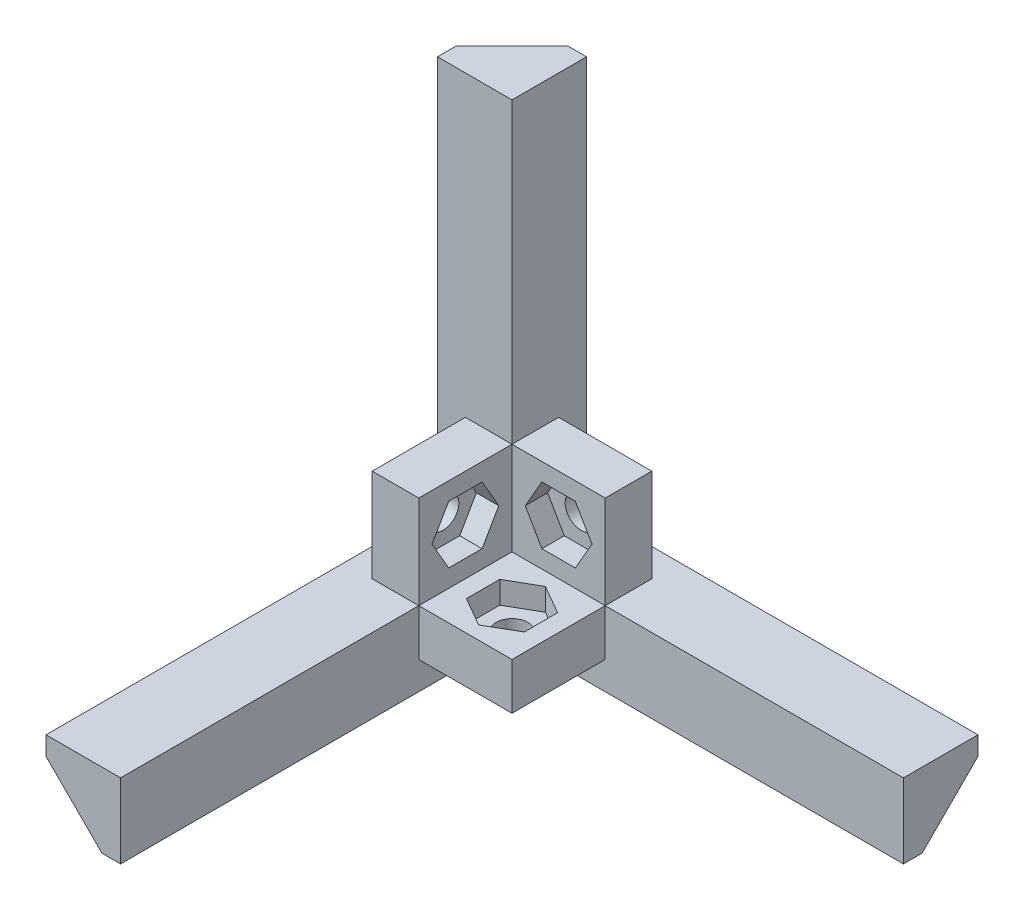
ISO-10303-21;
HEADER;
FILE_DESCRIPTION(('STEP AP214'),'2;1');
FILE_NAME('part.step','',(''),(''),'','','');
FILE_SCHEMA(('AUTOMOTIVE_DESIGN { 1 0 10303 214 1 1 1 1 }'));
ENDSEC;
DATA;
#1=APPLICATION_CONTEXT('core data for automotive mechanical design processes');
#2=APPLICATION_PROTOCOL_DEFINITION('international standard','automotive_design',2000,#1);
#3=PRODUCT_CONTEXT('',#1,'mechanical');
#4=PRODUCT('Part','Part','',(#3));
#5=PRODUCT_RELATED_PRODUCT_CATEGORY('part','',(#4));
#6=PRODUCT_DEFINITION_FORMATION('','',#4);
#7=PRODUCT_DEFINITION_CONTEXT('part definition',#1,'design');
#8=PRODUCT_DEFINITION('design','',#6,#7);
#9=PRODUCT_DEFINITION_SHAPE('','',#8);
#10=(LENGTH_UNIT() NAMED_UNIT(*) SI_UNIT(.MILLI.,.METRE.));
#11=(NAMED_UNIT(*) PLANE_ANGLE_UNIT() SI_UNIT($,.RADIAN.));
#12=(NAMED_UNIT(*) SI_UNIT($,.STERADIAN.) SOLID_ANGLE_UNIT());
#13=UNCERTAINTY_MEASURE_WITH_UNIT(LENGTH_MEASURE(1.E-05),#10,'distance_accuracy_value','');
#14=(GEOMETRIC_REPRESENTATION_CONTEXT(3) GLOBAL_UNCERTAINTY_ASSIGNED_CONTEXT((#13)) GLOBAL_UNIT_ASSIGNED_CONTEXT((#10,
#11,#12)) REPRESENTATION_CONTEXT('',''));
#15=CARTESIAN_POINT('',(0.,0.,0.));
#16=DIRECTION('',(0.,0.,1.));
#17=DIRECTION('',(1.,0.,0.));
#18=AXIS2_PLACEMENT_3D('',#15,#16,#17);
#19=CARTESIAN_POINT('',(42.,0.,8.));
#20=DIRECTION('',(0.,-1.,0.));
#21=DIRECTION('',(0.,0.,-1.));
#22=AXIS2_PLACEMENT_3D('',#19,#20,#21);
#23=PLANE('',#22);
#24=DIRECTION('',(0.,0.,-1.));
#25=VECTOR('',#24,1.);
#26=CARTESIAN_POINT('',(0.,0.,7.99999999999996));
#27=LINE('',#26,#25);
#28=CARTESIAN_POINT('',(0.,0.,18.));
#29=VERTEX_POINT('',#28);
#30=CARTESIAN_POINT('',(0.,0.,7.99999999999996));
#31=VERTEX_POINT('',#30);
#32=EDGE_CURVE('E390',#29,#31,#27,.T.);
#33=ORIENTED_EDGE('',*,*,#32,.F.);
#34=DIRECTION('',(-1.,0.,0.));
#35=VECTOR('',#34,1.);
#36=CARTESIAN_POINT('',(0.,0.,18.));
#37=LINE('',#36,#35);
#38=CARTESIAN_POINT('',(10.,0.,18.));
#39=VERTEX_POINT('',#38);
#40=EDGE_CURVE('E500',#39,#29,#37,.T.);
#41=ORIENTED_EDGE('',*,*,#40,.F.);
#42=DIRECTION('',(0.,0.,-1.));
#43=VECTOR('',#42,1.);
#44=CARTESIAN_POINT('',(10.,0.,18.));
#45=LINE('',#44,#43);
#46=CARTESIAN_POINT('',(10.,0.,8.));
#47=VERTEX_POINT('',#46);
#48=EDGE_CURVE('E503',#39,#47,#45,.T.);
#49=ORIENTED_EDGE('',*,*,#48,.T.);
#50=DIRECTION('',(-1.,0.,0.));
#51=VECTOR('',#50,1.);
#52=CARTESIAN_POINT('',(0.,0.,8.));
#53=LINE('',#52,#51);
#54=EDGE_CURVE('E519',#47,#31,#53,.T.);
#55=ORIENTED_EDGE('',*,*,#54,.T.);
#56=EDGE_LOOP('',(#33,#41,#49,#55));
#57=FACE_BOUND('',#56,.T.);
#58=DIRECTION('',(-0.866025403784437,0.,0.500000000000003));
#59=VECTOR('',#58,1.);
#60=CARTESIAN_POINT('',(8.10000000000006,0.,14.7897858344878));
#61=LINE('',#60,#59);
#62=CARTESIAN_POINT('',(8.10000000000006,0.,14.7897858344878));
#63=VERTEX_POINT('',#62);
#64=CARTESIAN_POINT('',(5.00000000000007,0.,16.5795716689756));
#65=VERTEX_POINT('',#64);
#66=EDGE_CURVE('E50',#63,#65,#61,.T.);
#67=ORIENTED_EDGE('',*,*,#66,.T.);
#68=DIRECTION('',(-0.86602540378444,0.,-0.499999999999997));
#69=VECTOR('',#68,1.);
#70=CARTESIAN_POINT('',(5.00000000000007,0.,16.5795716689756));
#71=LINE('',#70,#69);
#72=CARTESIAN_POINT('',(1.90000000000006,0.,14.7897858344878));
#73=VERTEX_POINT('',#72);
#74=EDGE_CURVE('E300',#65,#73,#71,.T.);
#75=ORIENTED_EDGE('',*,*,#74,.T.);
#76=DIRECTION('',(0.,0.,-1.));
#77=VECTOR('',#76,1.);
#78=CARTESIAN_POINT('',(1.90000000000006,0.,14.7897858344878));
#79=LINE('',#78,#77);
#80=CARTESIAN_POINT('',(1.90000000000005,0.,11.2102141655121));
#81=VERTEX_POINT('',#80);
#82=EDGE_CURVE('E303',#73,#81,#79,.T.);
#83=ORIENTED_EDGE('',*,*,#82,.T.);
#84=DIRECTION('',(0.866025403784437,0.,-0.500000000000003));
#85=VECTOR('',#84,1.);
#86=CARTESIAN_POINT('',(1.90000000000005,0.,11.2102141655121));
#87=LINE('',#86,#85);
#88=CARTESIAN_POINT('',(5.00000000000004,0.,9.42042833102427));
#89=VERTEX_POINT('',#88);
#90=EDGE_CURVE('E318',#81,#89,#87,.T.);
#91=ORIENTED_EDGE('',*,*,#90,.T.);
#92=DIRECTION('',(0.86602540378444,0.,0.499999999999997));
#93=VECTOR('',#92,1.);
#94=CARTESIAN_POINT('',(5.00000000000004,0.,9.42042833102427));
#95=LINE('',#94,#93);
#96=CARTESIAN_POINT('',(8.10000000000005,0.,11.2102141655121));
#97=VERTEX_POINT('',#96);
#98=EDGE_CURVE('E315',#89,#97,#95,.T.);
#99=ORIENTED_EDGE('',*,*,#98,.T.);
#100=DIRECTION('',(0.,0.,1.));
#101=VECTOR('',#100,1.);
#102=CARTESIAN_POINT('',(8.10000000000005,0.,11.2102141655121));
#103=LINE('',#102,#101);
#104=EDGE_CURVE('E313',#97,#63,#103,.T.);
#105=ORIENTED_EDGE('',*,*,#104,.T.);
#106=EDGE_LOOP('',(#67,#75,#83,#91,#99,#105));
#107=FACE_BOUND('',#106,.T.);
#108=ADVANCED_FACE('F33',(#57,#107),#23,.F.);
#109=CARTESIAN_POINT('',(5.00000000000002,42.0010000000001,13.));
#110=DIRECTION('',(0.,-1.,0.));
#111=DIRECTION('',(1.,0.,0.));
#112=AXIS2_PLACEMENT_3D('',#109,#110,#111);
#113=CYLINDRICAL_SURFACE('',#112,1.7);
#114=CARTESIAN_POINT('',(5.00000000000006,-5.,12.9999999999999));
#115=DIRECTION('',(0.,1.,0.));
#116=DIRECTION('',(0.,0.,1.));
#117=AXIS2_PLACEMENT_3D('',#114,#115,#116);
#118=CIRCLE('',#117,1.7);
#119=CARTESIAN_POINT('',(5.00000000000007,-5.,14.6999999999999));
#120=VERTEX_POINT('',#119);
#121=EDGE_CURVE('E332',#120,#120,#118,.T.);
#122=ORIENTED_EDGE('',*,*,#121,.F.);
#123=EDGE_LOOP('',(#122));
#124=FACE_BOUND('',#123,.T.);
#125=CARTESIAN_POINT('',(5.00000000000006,-2.4,12.9999999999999));
#126=DIRECTION('',(0.,1.,0.));
#127=DIRECTION('',(0.,0.,1.));
#128=AXIS2_PLACEMENT_3D('',#125,#126,#127);
#129=CIRCLE('',#128,1.7);
#130=CARTESIAN_POINT('',(5.00000000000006,-2.4,14.6999999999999));
#131=VERTEX_POINT('',#130);
#132=EDGE_CURVE('E37',#131,#131,#129,.T.);
#133=ORIENTED_EDGE('',*,*,#132,.T.);
#134=EDGE_LOOP('',(#133));
#135=FACE_BOUND('',#134,.T.);
#136=ADVANCED_FACE('F608',(#124,#135),#113,.F.);
#137=CARTESIAN_POINT('',(42.0010000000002,5.00000000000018,12.9999999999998));
#138=DIRECTION('',(-1.,0.,0.));
#139=DIRECTION('',(0.,-1.,0.));
#140=AXIS2_PLACEMENT_3D('',#137,#138,#139);
#141=CYLINDRICAL_SURFACE('',#140,1.7);
#142=CARTESIAN_POINT('',(-4.99999999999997,4.99999999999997,13.));
#143=DIRECTION('',(-1.,0.,0.));
#144=DIRECTION('',(0.,0.,1.));
#145=AXIS2_PLACEMENT_3D('',#142,#143,#144);
#146=CIRCLE('',#145,1.7);
#147=CARTESIAN_POINT('',(-4.99999999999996,4.99999999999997,14.7));
#148=VERTEX_POINT('',#147);
#149=EDGE_CURVE('E382',#148,#148,#146,.T.);
#150=ORIENTED_EDGE('',*,*,#149,.T.);
#151=EDGE_LOOP('',(#150));
#152=FACE_BOUND('',#151,.T.);
#153=CARTESIAN_POINT('',(-2.39999999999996,4.99999999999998,13.));
#154=DIRECTION('',(1.,0.,0.));
#155=DIRECTION('',(0.,1.,0.));
#156=AXIS2_PLACEMENT_3D('',#153,#154,#155);
#157=CIRCLE('',#156,1.7);
#158=CARTESIAN_POINT('',(-2.39999999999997,6.69999999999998,13.));
#159=VERTEX_POINT('',#158);
#160=EDGE_CURVE('E372',#159,#159,#157,.F.);
#161=ORIENTED_EDGE('',*,*,#160,.F.);
#162=EDGE_LOOP('',(#161));
#163=FACE_BOUND('',#162,.T.);
#164=ADVANCED_FACE('F605',(#152,#163),#141,.F.);
#165=CARTESIAN_POINT('',(0.,0.,8.));
#166=DIRECTION('',(0.,0.,-1.));
#167=DIRECTION('',(-1.,0.,0.));
#168=AXIS2_PLACEMENT_3D('',#165,#166,#167);
#169=PLANE('',#168);
#170=DIRECTION('',(0.,-1.,0.));
#171=VECTOR('',#170,1.);
#172=CARTESIAN_POINT('',(-5.00000000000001,9.99999999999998,7.99999999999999));
#173=LINE('',#172,#171);
#174=CARTESIAN_POINT('',(-5.00000000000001,9.99999999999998,8.));
#175=VERTEX_POINT('',#174);
#176=CARTESIAN_POINT('',(-4.99999999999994,0.,8.));
#177=VERTEX_POINT('',#176);
#178=EDGE_CURVE('E413',#175,#177,#173,.T.);
#179=ORIENTED_EDGE('',*,*,#178,.F.);
#180=DIRECTION('',(-1.,0.,0.));
#181=VECTOR('',#180,1.);
#182=CARTESIAN_POINT('',(-5.00000000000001,9.99999999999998,7.99999999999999));
#183=LINE('',#182,#181);
#184=CARTESIAN_POINT('',(0.,10.,7.99999999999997));
#185=VERTEX_POINT('',#184);
#186=EDGE_CURVE('E386',#185,#175,#183,.T.);
#187=ORIENTED_EDGE('',*,*,#186,.F.);
#188=DIRECTION('',(0.,1.,0.));
#189=VECTOR('',#188,1.);
#190=CARTESIAN_POINT('',(0.,0.,8.));
#191=LINE('',#190,#189);
#192=CARTESIAN_POINT('',(0.,42.,8.));
#193=VERTEX_POINT('',#192);
#194=EDGE_CURVE('E543',#185,#193,#191,.T.);
#195=ORIENTED_EDGE('',*,*,#194,.T.);
#196=DIRECTION('',(-1.,0.,0.));
#197=VECTOR('',#196,1.);
#198=CARTESIAN_POINT('',(0.,42.,8.));
#199=LINE('',#198,#197);
#200=CARTESIAN_POINT('',(-8.,42.,8.));
#201=VERTEX_POINT('',#200);
#202=EDGE_CURVE('E546',#193,#201,#199,.T.);
#203=ORIENTED_EDGE('',*,*,#202,.T.);
#204=DIRECTION('',(0.,-1.,0.));
#205=VECTOR('',#204,1.);
#206=CARTESIAN_POINT('',(-8.,42.,8.));
#207=LINE('',#206,#205);
#208=CARTESIAN_POINT('',(-8.,0.,8.));
#209=VERTEX_POINT('',#208);
#210=EDGE_CURVE('E548',#201,#209,#207,.T.);
#211=ORIENTED_EDGE('',*,*,#210,.T.);
#212=EDGE_CURVE('E529',#177,#209,#53,.T.);
#213=ORIENTED_EDGE('',*,*,#212,.F.);
#214=EDGE_LOOP('',(#179,#187,#195,#203,#211,#213));
#215=FACE_BOUND('',#214,.T.);
#216=ADVANCED_FACE('F607',(#215),#169,.F.);
#217=DIRECTION('',(0.5,-0.866025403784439,0.));
#218=VECTOR('',#217,1.);
#219=CARTESIAN_POINT('',(6.78978583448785,8.09999999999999,7.99999999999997));
#220=LINE('',#219,#218);
#221=CARTESIAN_POINT('',(6.78978583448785,8.09999999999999,8.));
#222=VERTEX_POINT('',#221);
#223=CARTESIAN_POINT('',(8.57957166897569,5.,7.99999999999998));
#224=VERTEX_POINT('',#223);
#225=EDGE_CURVE('E432',#222,#224,#220,.T.);
#226=ORIENTED_EDGE('',*,*,#225,.T.);
#227=DIRECTION('',(-0.5,-0.866025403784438,0.));
#228=VECTOR('',#227,1.);
#229=CARTESIAN_POINT('',(8.57957166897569,5.,7.99999999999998));
#230=LINE('',#229,#228);
#231=CARTESIAN_POINT('',(6.78978583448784,1.9,7.99999999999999));
#232=VERTEX_POINT('',#231);
#233=EDGE_CURVE('E421',#224,#232,#230,.T.);
#234=ORIENTED_EDGE('',*,*,#233,.T.);
#235=DIRECTION('',(-1.,0.,0.));
#236=VECTOR('',#235,1.);
#237=CARTESIAN_POINT('',(6.78978583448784,1.9,7.99999999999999));
#238=LINE('',#237,#236);
#239=CARTESIAN_POINT('',(3.21021416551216,1.9,7.99999999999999));
#240=VERTEX_POINT('',#239);
#241=EDGE_CURVE('E445',#232,#240,#238,.T.);
#242=ORIENTED_EDGE('',*,*,#241,.T.);
#243=DIRECTION('',(-0.5,0.866025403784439,0.));
#244=VECTOR('',#243,1.);
#245=CARTESIAN_POINT('',(3.21021416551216,1.9,7.99999999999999));
#246=LINE('',#245,#244);
#247=CARTESIAN_POINT('',(1.42042833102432,5.,7.99999999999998));
#248=VERTEX_POINT('',#247);
#249=EDGE_CURVE('E442',#240,#248,#246,.T.);
#250=ORIENTED_EDGE('',*,*,#249,.T.);
#251=DIRECTION('',(0.5,0.866025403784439,0.));
#252=VECTOR('',#251,1.);
#253=CARTESIAN_POINT('',(1.42042833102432,5.,7.99999999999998));
#254=LINE('',#253,#252);
#255=CARTESIAN_POINT('',(3.21021416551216,8.09999999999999,7.99999999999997));
#256=VERTEX_POINT('',#255);
#257=EDGE_CURVE('E439',#248,#256,#254,.T.);
#258=ORIENTED_EDGE('',*,*,#257,.T.);
#259=DIRECTION('',(1.,0.,0.));
#260=VECTOR('',#259,1.);
#261=CARTESIAN_POINT('',(3.21021416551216,8.09999999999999,7.99999999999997));
#262=LINE('',#261,#260);
#263=EDGE_CURVE('E435',#256,#222,#262,.T.);
#264=ORIENTED_EDGE('',*,*,#263,.T.);
#265=EDGE_LOOP('',(#226,#234,#242,#250,#258,#264));
#266=FACE_BOUND('',#265,.T.);
#267=DIRECTION('',(0.,-1.,0.));
#268=VECTOR('',#267,1.);
#269=CARTESIAN_POINT('',(0.,10.,7.99999999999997));
#270=LINE('',#269,#268);
#271=EDGE_CURVE('E397',#185,#31,#270,.T.);
#272=ORIENTED_EDGE('',*,*,#271,.T.);
#273=ORIENTED_EDGE('',*,*,#54,.F.);
#274=DIRECTION('',(0.,-1.,0.));
#275=VECTOR('',#274,1.);
#276=CARTESIAN_POINT('',(10.,10.,7.99999999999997));
#277=LINE('',#276,#275);
#278=CARTESIAN_POINT('',(10.,10.,7.99999999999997));
#279=VERTEX_POINT('',#278);
#280=EDGE_CURVE('E488',#279,#47,#277,.T.);
#281=ORIENTED_EDGE('',*,*,#280,.F.);
#282=DIRECTION('',(-1.,0.,0.));
#283=VECTOR('',#282,1.);
#284=CARTESIAN_POINT('',(0.,10.,7.99999999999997));
#285=LINE('',#284,#283);
#286=EDGE_CURVE('E470',#279,#185,#285,.T.);
#287=ORIENTED_EDGE('',*,*,#286,.T.);
#288=EDGE_LOOP('',(#272,#273,#281,#287));
#289=FACE_BOUND('',#288,.T.);
#290=ADVANCED_FACE('F615',(#266,#289),#169,.F.);
#291=DIRECTION('',(0.,0.,1.));
#292=VECTOR('',#291,1.);
#293=CARTESIAN_POINT('',(-4.99999999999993,0.,18.));
#294=LINE('',#293,#292);
#295=CARTESIAN_POINT('',(-4.99999999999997,0.,18.));
#296=VERTEX_POINT('',#295);
#297=EDGE_CURVE('E385',#177,#296,#294,.T.);
#298=ORIENTED_EDGE('',*,*,#297,.F.);
#299=ORIENTED_EDGE('',*,*,#212,.T.);
#300=DIRECTION('',(0.,0.,-1.));
#301=VECTOR('',#300,1.);
#302=CARTESIAN_POINT('',(-8.,0.,50.));
#303=LINE('',#302,#301);
#304=CARTESIAN_POINT('',(-8.,0.,50.));
#305=VERTEX_POINT('',#304);
#306=EDGE_CURVE('E533',#305,#209,#303,.T.);
#307=ORIENTED_EDGE('',*,*,#306,.F.);
#308=DIRECTION('',(-1.,0.,0.));
#309=VECTOR('',#308,1.);
#310=CARTESIAN_POINT('',(0.,0.,50.));
#311=LINE('',#310,#309);
#312=CARTESIAN_POINT('',(0.,0.,50.));
#313=VERTEX_POINT('',#312);
#314=EDGE_CURVE('E518',#313,#305,#311,.T.);
#315=ORIENTED_EDGE('',*,*,#314,.F.);
#316=DIRECTION('',(0.,0.,-1.));
#317=VECTOR('',#316,1.);
#318=CARTESIAN_POINT('',(0.,0.,50.));
#319=LINE('',#318,#317);
#320=EDGE_CURVE('E536',#313,#29,#319,.T.);
#321=ORIENTED_EDGE('',*,*,#320,.T.);
#322=DIRECTION('',(1.,0.,0.));
#323=VECTOR('',#322,1.);
#324=CARTESIAN_POINT('',(0.,0.,18.));
#325=LINE('',#324,#323);
#326=EDGE_CURVE('E400',#296,#29,#325,.T.);
#327=ORIENTED_EDGE('',*,*,#326,.F.);
#328=EDGE_LOOP('',(#298,#299,#307,#315,#321,#327));
#329=FACE_BOUND('',#328,.T.);
#330=ADVANCED_FACE('F626',(#329),#23,.F.);
#331=CARTESIAN_POINT('',(5.,5.00000000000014,50.0010000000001));
#332=DIRECTION('',(0.,0.,-1.));
#333=DIRECTION('',(0.,1.,0.));
#334=AXIS2_PLACEMENT_3D('',#331,#332,#333);
#335=CYLINDRICAL_SURFACE('',#334,1.7);
#336=CARTESIAN_POINT('',(5.,4.99999999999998,2.99999999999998));
#337=DIRECTION('',(0.,0.,1.));
#338=DIRECTION('',(1.,0.,0.));
#339=AXIS2_PLACEMENT_3D('',#336,#337,#338);
#340=CIRCLE('',#339,1.7);
#341=CARTESIAN_POINT('',(6.7,4.99999999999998,2.99999999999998));
#342=VERTEX_POINT('',#341);
#343=EDGE_CURVE('E464',#342,#342,#340,.T.);
#344=ORIENTED_EDGE('',*,*,#343,.F.);
#345=EDGE_LOOP('',(#344));
#346=FACE_BOUND('',#345,.T.);
#347=CARTESIAN_POINT('',(5.,4.99999999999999,5.59999999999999));
#348=DIRECTION('',(0.,0.,1.));
#349=DIRECTION('',(0.,-1.,0.));
#350=AXIS2_PLACEMENT_3D('',#347,#348,#349);
#351=CIRCLE('',#350,1.7);
#352=CARTESIAN_POINT('',(5.,3.29999999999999,5.59999999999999));
#353=VERTEX_POINT('',#352);
#354=EDGE_CURVE('E453',#353,#353,#351,.T.);
#355=ORIENTED_EDGE('',*,*,#354,.T.);
#356=EDGE_LOOP('',(#355));
#357=FACE_BOUND('',#356,.T.);
#358=ADVANCED_FACE('F634',(#346,#357),#335,.F.);
#359=DIRECTION('',(1.,0.,0.));
#360=VECTOR('',#359,1.);
#361=CARTESIAN_POINT('',(10.,-5.,8.));
#362=LINE('',#361,#360);
#363=CARTESIAN_POINT('',(0.,-5.,8.));
#364=VERTEX_POINT('',#363);
#365=CARTESIAN_POINT('',(10.,-5.,8.));
#366=VERTEX_POINT('',#365);
#367=EDGE_CURVE('E491',#364,#366,#362,.T.);
#368=ORIENTED_EDGE('',*,*,#367,.F.);
#369=DIRECTION('',(0.,1.,0.));
#370=VECTOR('',#369,1.);
#371=CARTESIAN_POINT('',(0.,-8.,8.));
#372=LINE('',#371,#370);
#373=CARTESIAN_POINT('',(0.,-8.,8.));
#374=VERTEX_POINT('',#373);
#375=EDGE_CURVE('E514',#374,#364,#372,.T.);
#376=ORIENTED_EDGE('',*,*,#375,.F.);
#377=DIRECTION('',(1.,0.,0.));
#378=VECTOR('',#377,1.);
#379=CARTESIAN_POINT('',(-8.,-8.,8.));
#380=LINE('',#379,#378);
#381=CARTESIAN_POINT('',(42.,-8.,8.));
#382=VERTEX_POINT('',#381);
#383=EDGE_CURVE('E551',#374,#382,#380,.T.);
#384=ORIENTED_EDGE('',*,*,#383,.T.);
#385=DIRECTION('',(0.,1.,0.));
#386=VECTOR('',#385,1.);
#387=CARTESIAN_POINT('',(42.,-8.,8.));
#388=LINE('',#387,#386);
#389=CARTESIAN_POINT('',(42.,0.,8.));
#390=VERTEX_POINT('',#389);
#391=EDGE_CURVE('E553',#382,#390,#388,.T.);
#392=ORIENTED_EDGE('',*,*,#391,.T.);
#393=DIRECTION('',(-1.,0.,0.));
#394=VECTOR('',#393,1.);
#395=CARTESIAN_POINT('',(42.,0.,8.));
#396=LINE('',#395,#394);
#397=EDGE_CURVE('E540',#390,#47,#396,.T.);
#398=ORIENTED_EDGE('',*,*,#397,.T.);
#399=DIRECTION('',(0.,1.,0.));
#400=VECTOR('',#399,1.);
#401=CARTESIAN_POINT('',(10.,0.,8.));
#402=LINE('',#401,#400);
#403=EDGE_CURVE('E496',#366,#47,#402,.T.);
#404=ORIENTED_EDGE('',*,*,#403,.F.);
#405=EDGE_LOOP('',(#368,#376,#384,#392,#398,#404));
#406=FACE_BOUND('',#405,.T.);
#407=ADVANCED_FACE('F618',(#406),#169,.F.);
#408=CARTESIAN_POINT('',(0.,-8.,50.));
#409=DIRECTION('',(-1.,0.,0.));
#410=DIRECTION('',(0.,0.,1.));
#411=AXIS2_PLACEMENT_3D('',#408,#409,#410);
#412=PLANE('',#411);
#413=DIRECTION('',(0.,0.,-1.));
#414=VECTOR('',#413,1.);
#415=CARTESIAN_POINT('',(0.,-5.,18.));
#416=LINE('',#415,#414);
#417=CARTESIAN_POINT('',(0.,-5.,18.));
#418=VERTEX_POINT('',#417);
#419=EDGE_CURVE('E512',#418,#364,#416,.T.);
#420=ORIENTED_EDGE('',*,*,#419,.F.);
#421=DIRECTION('',(0.,-1.,0.));
#422=VECTOR('',#421,1.);
#423=CARTESIAN_POINT('',(0.,-5.,18.));
#424=LINE('',#423,#422);
#425=EDGE_CURVE('E492',#29,#418,#424,.T.);
#426=ORIENTED_EDGE('',*,*,#425,.F.);
#427=ORIENTED_EDGE('',*,*,#320,.F.);
#428=DIRECTION('',(0.,1.,0.));
#429=VECTOR('',#428,1.);
#430=CARTESIAN_POINT('',(0.,-8.,50.));
#431=LINE('',#430,#429);
#432=CARTESIAN_POINT('',(0.,-8.,50.));
#433=VERTEX_POINT('',#432);
#434=EDGE_CURVE('E515',#433,#313,#431,.T.);
#435=ORIENTED_EDGE('',*,*,#434,.F.);
#436=DIRECTION('',(0.,0.,-1.));
#437=VECTOR('',#436,1.);
#438=CARTESIAN_POINT('',(0.,-8.,50.));
#439=LINE('',#438,#437);
#440=EDGE_CURVE('E526',#433,#374,#439,.T.);
#441=ORIENTED_EDGE('',*,*,#440,.T.);
#442=ORIENTED_EDGE('',*,*,#375,.T.);
#443=EDGE_LOOP('',(#420,#426,#427,#435,#441,#442));
#444=FACE_BOUND('',#443,.T.);
#445=ADVANCED_FACE('F638',(#444),#412,.F.);
#446=DIRECTION('',(1.,0.,0.));
#447=VECTOR('',#446,1.);
#448=CARTESIAN_POINT('',(10.,0.,3.));
#449=LINE('',#448,#447);
#450=CARTESIAN_POINT('',(0.,0.,3.));
#451=VERTEX_POINT('',#450);
#452=CARTESIAN_POINT('',(9.99999999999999,0.,3.));
#453=VERTEX_POINT('',#452);
#454=EDGE_CURVE('E471',#451,#453,#449,.T.);
#455=ORIENTED_EDGE('',*,*,#454,.T.);
#456=DIRECTION('',(0.,0.,1.));
#457=VECTOR('',#456,1.);
#458=CARTESIAN_POINT('',(10.,0.,8.));
#459=LINE('',#458,#457);
#460=EDGE_CURVE('E467',#453,#47,#459,.T.);
#461=ORIENTED_EDGE('',*,*,#460,.T.);
#462=ORIENTED_EDGE('',*,*,#397,.F.);
#463=DIRECTION('',(0.,0.,-1.));
#464=VECTOR('',#463,1.);
#465=CARTESIAN_POINT('',(42.,0.,8.));
#466=LINE('',#465,#464);
#467=CARTESIAN_POINT('',(42.,0.,0.));
#468=VERTEX_POINT('',#467);
#469=EDGE_CURVE('E555',#390,#468,#466,.T.);
#470=ORIENTED_EDGE('',*,*,#469,.T.);
#471=DIRECTION('',(-1.,0.,0.));
#472=VECTOR('',#471,1.);
#473=CARTESIAN_POINT('',(42.,0.,0.));
#474=LINE('',#473,#472);
#475=CARTESIAN_POINT('',(0.,0.,0.));
#476=VERTEX_POINT('',#475);
#477=EDGE_CURVE('E539',#468,#476,#474,.T.);
#478=ORIENTED_EDGE('',*,*,#477,.T.);
#479=DIRECTION('',(0.,0.,-1.));
#480=VECTOR('',#479,1.);
#481=CARTESIAN_POINT('',(0.,0.,8.));
#482=LINE('',#481,#480);
#483=EDGE_CURVE('E575',#451,#476,#482,.T.);
#484=ORIENTED_EDGE('',*,*,#483,.F.);
#485=EDGE_LOOP('',(#455,#461,#462,#470,#478,#484));
#486=FACE_BOUND('',#485,.T.);
#487=ADVANCED_FACE('F627',(#486),#23,.F.);
#488=CARTESIAN_POINT('',(0.,0.,8.));
#489=DIRECTION('',(-1.,0.,0.));
#490=DIRECTION('',(0.,0.,1.));
#491=AXIS2_PLACEMENT_3D('',#488,#489,#490);
#492=PLANE('',#491);
#493=DIRECTION('',(0.,0.,-1.));
#494=VECTOR('',#493,1.);
#495=CARTESIAN_POINT('',(0.,9.99999999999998,2.99999999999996));
#496=LINE('',#495,#494);
#497=CARTESIAN_POINT('',(0.,9.99999999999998,2.99999999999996));
#498=VERTEX_POINT('',#497);
#499=EDGE_CURVE('E468',#185,#498,#496,.T.);
#500=ORIENTED_EDGE('',*,*,#499,.T.);
#501=DIRECTION('',(0.,-1.,0.));
#502=VECTOR('',#501,1.);
#503=CARTESIAN_POINT('',(0.,9.99999999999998,2.99999999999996));
#504=LINE('',#503,#502);
#505=EDGE_CURVE('E480',#498,#451,#504,.T.);
#506=ORIENTED_EDGE('',*,*,#505,.T.);
#507=ORIENTED_EDGE('',*,*,#483,.T.);
#508=DIRECTION('',(0.,1.,0.));
#509=VECTOR('',#508,1.);
#510=CARTESIAN_POINT('',(0.,0.,0.));
#511=LINE('',#510,#509);
#512=CARTESIAN_POINT('',(0.,42.,0.));
#513=VERTEX_POINT('',#512);
#514=EDGE_CURVE('E558',#476,#513,#511,.T.);
#515=ORIENTED_EDGE('',*,*,#514,.T.);
#516=DIRECTION('',(0.,0.,-1.));
#517=VECTOR('',#516,1.);
#518=CARTESIAN_POINT('',(0.,42.,8.));
#519=LINE('',#518,#517);
#520=EDGE_CURVE('E572',#193,#513,#519,.T.);
#521=ORIENTED_EDGE('',*,*,#520,.F.);
#522=ORIENTED_EDGE('',*,*,#194,.F.);
#523=EDGE_LOOP('',(#500,#506,#507,#515,#521,#522));
#524=FACE_BOUND('',#523,.T.);
#525=ADVANCED_FACE('F637',(#524),#492,.F.);
#526=CARTESIAN_POINT('',(0.,42.,8.));
#527=DIRECTION('',(0.,-1.,0.));
#528=DIRECTION('',(0.,0.,-1.));
#529=AXIS2_PLACEMENT_3D('',#526,#527,#528);
#530=PLANE('',#529);
#531=DIRECTION('',(-1.,0.,0.));
#532=VECTOR('',#531,1.);
#533=CARTESIAN_POINT('',(0.,42.,0.));
#534=LINE('',#533,#532);
#535=CARTESIAN_POINT('',(-1.99999999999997,42.,0.));
#536=VERTEX_POINT('',#535);
#537=EDGE_CURVE('E560',#513,#536,#534,.T.);
#538=ORIENTED_EDGE('',*,*,#537,.T.);
#539=DIRECTION('',(-0.707106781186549,0.,0.707106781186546));
#540=VECTOR('',#539,1.);
#541=CARTESIAN_POINT('',(-8.,42.,6.00000000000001));
#542=LINE('',#541,#540);
#543=CARTESIAN_POINT('',(-8.,42.,6.00000000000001));
#544=VERTEX_POINT('',#543);
#545=EDGE_CURVE('E588',#536,#544,#542,.T.);
#546=ORIENTED_EDGE('',*,*,#545,.T.);
#547=DIRECTION('',(0.,0.,-1.));
#548=VECTOR('',#547,1.);
#549=CARTESIAN_POINT('',(-8.,42.,8.));
#550=LINE('',#549,#548);
#551=EDGE_CURVE('E569',#201,#544,#550,.T.);
#552=ORIENTED_EDGE('',*,*,#551,.F.);
#553=ORIENTED_EDGE('',*,*,#202,.F.);
#554=ORIENTED_EDGE('',*,*,#520,.T.);
#555=EDGE_LOOP('',(#538,#546,#552,#553,#554));
#556=FACE_BOUND('',#555,.T.);
#557=ADVANCED_FACE('F644',(#556),#530,.F.);
#558=CARTESIAN_POINT('',(-8.,42.,8.));
#559=DIRECTION('',(1.,0.,0.));
#560=DIRECTION('',(0.,0.,-1.));
#561=AXIS2_PLACEMENT_3D('',#558,#559,#560);
#562=PLANE('',#561);
#563=ORIENTED_EDGE('',*,*,#551,.T.);
#564=DIRECTION('',(0.,-1.,0.));
#565=VECTOR('',#564,1.);
#566=CARTESIAN_POINT('',(-8.,-8.,6.00000000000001));
#567=LINE('',#566,#565);
#568=CARTESIAN_POINT('',(-8.,-1.99999999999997,6.00000000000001));
#569=VERTEX_POINT('',#568);
#570=EDGE_CURVE('E581',#544,#569,#567,.T.);
#571=ORIENTED_EDGE('',*,*,#570,.T.);
#572=DIRECTION('',(0.,0.,1.));
#573=VECTOR('',#572,1.);
#574=CARTESIAN_POINT('',(-8.,-1.99999999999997,8.));
#575=LINE('',#574,#573);
#576=CARTESIAN_POINT('',(-8.,-1.99999999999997,50.));
#577=VERTEX_POINT('',#576);
#578=EDGE_CURVE('E577',#569,#577,#575,.T.);
#579=ORIENTED_EDGE('',*,*,#578,.T.);
#580=DIRECTION('',(0.,-1.,0.));
#581=VECTOR('',#580,1.);
#582=CARTESIAN_POINT('',(-8.,0.,50.));
#583=LINE('',#582,#581);
#584=EDGE_CURVE('E521',#305,#577,#583,.T.);
#585=ORIENTED_EDGE('',*,*,#584,.F.);
#586=ORIENTED_EDGE('',*,*,#306,.T.);
#587=ORIENTED_EDGE('',*,*,#210,.F.);
#588=EDGE_LOOP('',(#563,#571,#579,#585,#586,#587));
#589=FACE_BOUND('',#588,.T.);
#590=ADVANCED_FACE('F696',(#589),#562,.F.);
#591=CARTESIAN_POINT('',(-8.,-8.,8.));
#592=DIRECTION('',(0.,1.,0.));
#593=DIRECTION('',(0.,0.,1.));
#594=AXIS2_PLACEMENT_3D('',#591,#592,#593);
#595=PLANE('',#594);
#596=DIRECTION('',(1.,0.,0.));
#597=VECTOR('',#596,1.);
#598=CARTESIAN_POINT('',(-8.,-8.,50.));
#599=LINE('',#598,#597);
#600=CARTESIAN_POINT('',(-1.99999999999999,-8.,50.));
#601=VERTEX_POINT('',#600);
#602=EDGE_CURVE('E524',#601,#433,#599,.T.);
#603=ORIENTED_EDGE('',*,*,#602,.F.);
#604=DIRECTION('',(0.,0.,-1.));
#605=VECTOR('',#604,1.);
#606=CARTESIAN_POINT('',(-1.99999999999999,-8.,8.));
#607=LINE('',#606,#605);
#608=CARTESIAN_POINT('',(-1.99999999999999,-8.,6.00000000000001));
#609=VERTEX_POINT('',#608);
#610=EDGE_CURVE('E592',#601,#609,#607,.T.);
#611=ORIENTED_EDGE('',*,*,#610,.T.);
#612=DIRECTION('',(1.,0.,0.));
#613=VECTOR('',#612,1.);
#614=CARTESIAN_POINT('',(42.,-8.,6.00000000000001));
#615=LINE('',#614,#613);
#616=CARTESIAN_POINT('',(42.,-8.,6.00000000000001));
#617=VERTEX_POINT('',#616);
#618=EDGE_CURVE('E590',#609,#617,#615,.T.);
#619=ORIENTED_EDGE('',*,*,#618,.T.);
#620=DIRECTION('',(0.,0.,-1.));
#621=VECTOR('',#620,1.);
#622=CARTESIAN_POINT('',(42.,-8.,8.));
#623=LINE('',#622,#621);
#624=EDGE_CURVE('E566',#382,#617,#623,.T.);
#625=ORIENTED_EDGE('',*,*,#624,.F.);
#626=ORIENTED_EDGE('',*,*,#383,.F.);
#627=ORIENTED_EDGE('',*,*,#440,.F.);
#628=EDGE_LOOP('',(#603,#611,#619,#625,#626,#627));
#629=FACE_BOUND('',#628,.T.);
#630=ADVANCED_FACE('F707',(#629),#595,.F.);
#631=CARTESIAN_POINT('',(42.,-8.,8.));
#632=DIRECTION('',(-1.,0.,0.));
#633=DIRECTION('',(0.,0.,1.));
#634=AXIS2_PLACEMENT_3D('',#631,#632,#633);
#635=PLANE('',#634);
#636=ORIENTED_EDGE('',*,*,#624,.T.);
#637=DIRECTION('',(0.,0.707106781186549,-0.707106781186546));
#638=VECTOR('',#637,1.);
#639=CARTESIAN_POINT('',(42.,-8.,6.00000000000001));
#640=LINE('',#639,#638);
#641=CARTESIAN_POINT('',(42.,-1.99999999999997,0.));
#642=VERTEX_POINT('',#641);
#643=EDGE_CURVE('E11',#617,#642,#640,.T.);
#644=ORIENTED_EDGE('',*,*,#643,.T.);
#645=DIRECTION('',(0.,1.,0.));
#646=VECTOR('',#645,1.);
#647=CARTESIAN_POINT('',(42.,-8.,0.));
#648=LINE('',#647,#646);
#649=EDGE_CURVE('E544',#642,#468,#648,.T.);
#650=ORIENTED_EDGE('',*,*,#649,.T.);
#651=ORIENTED_EDGE('',*,*,#469,.F.);
#652=ORIENTED_EDGE('',*,*,#391,.F.);
#653=EDGE_LOOP('',(#636,#644,#650,#651,#652));
#654=FACE_BOUND('',#653,.T.);
#655=ADVANCED_FACE('F718',(#654),#635,.F.);
#656=CARTESIAN_POINT('',(0.,0.,0.));
#657=DIRECTION('',(0.,0.,-1.));
#658=DIRECTION('',(-1.,0.,0.));
#659=AXIS2_PLACEMENT_3D('',#656,#657,#658);
#660=PLANE('',#659);
#661=DIRECTION('',(-1.,0.,0.));
#662=VECTOR('',#661,1.);
#663=CARTESIAN_POINT('',(-8.,-1.99999999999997,0.));
#664=LINE('',#663,#662);
#665=CARTESIAN_POINT('',(-1.99999999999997,-1.99999999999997,0.));
#666=VERTEX_POINT('',#665);
#667=EDGE_CURVE('E584',#642,#666,#664,.T.);
#668=ORIENTED_EDGE('',*,*,#667,.T.);
#669=DIRECTION('',(0.,1.,0.));
#670=VECTOR('',#669,1.);
#671=CARTESIAN_POINT('',(-1.99999999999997,42.,0.));
#672=LINE('',#671,#670);
#673=EDGE_CURVE('E586',#666,#536,#672,.T.);
#674=ORIENTED_EDGE('',*,*,#673,.T.);
#675=ORIENTED_EDGE('',*,*,#537,.F.);
#676=ORIENTED_EDGE('',*,*,#514,.F.);
#677=ORIENTED_EDGE('',*,*,#477,.F.);
#678=ORIENTED_EDGE('',*,*,#649,.F.);
#679=EDGE_LOOP('',(#668,#674,#675,#676,#677,#678));
#680=FACE_BOUND('',#679,.T.);
#681=ADVANCED_FACE('F723',(#680),#660,.T.);
#682=CARTESIAN_POINT('',(0.,0.,50.));
#683=DIRECTION('',(0.,0.,1.));
#684=DIRECTION('',(1.,0.,0.));
#685=AXIS2_PLACEMENT_3D('',#682,#683,#684);
#686=PLANE('',#685);
#687=ORIENTED_EDGE('',*,*,#584,.T.);
#688=DIRECTION('',(-0.707106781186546,0.707106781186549,0.));
#689=VECTOR('',#688,1.);
#690=CARTESIAN_POINT('',(-5.,-4.99999999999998,50.));
#691=LINE('',#690,#689);
#692=EDGE_CURVE('E42',#577,#601,#691,.F.);
#693=ORIENTED_EDGE('',*,*,#692,.T.);
#694=ORIENTED_EDGE('',*,*,#602,.T.);
#695=ORIENTED_EDGE('',*,*,#434,.T.);
#696=ORIENTED_EDGE('',*,*,#314,.T.);
#697=EDGE_LOOP('',(#687,#693,#694,#695,#696));
#698=FACE_BOUND('',#697,.T.);
#699=ADVANCED_FACE('F700',(#698),#686,.T.);
#700=CARTESIAN_POINT('',(10.,-5.,18.));
#701=DIRECTION('',(0.,1.,0.));
#702=DIRECTION('',(-1.,0.,0.));
#703=AXIS2_PLACEMENT_3D('',#700,#701,#702);
#704=PLANE('',#703);
#705=ORIENTED_EDGE('',*,*,#121,.T.);
#706=EDGE_LOOP('',(#705));
#707=FACE_BOUND('',#706,.T.);
#708=ORIENTED_EDGE('',*,*,#367,.T.);
#709=DIRECTION('',(0.,0.,-1.));
#710=VECTOR('',#709,1.);
#711=CARTESIAN_POINT('',(10.,-5.,18.));
#712=LINE('',#711,#710);
#713=CARTESIAN_POINT('',(10.,-5.,18.));
#714=VERTEX_POINT('',#713);
#715=EDGE_CURVE('E509',#714,#366,#712,.T.);
#716=ORIENTED_EDGE('',*,*,#715,.F.);
#717=DIRECTION('',(1.,0.,0.));
#718=VECTOR('',#717,1.);
#719=CARTESIAN_POINT('',(10.,-5.,18.));
#720=LINE('',#719,#718);
#721=EDGE_CURVE('E495',#418,#714,#720,.T.);
#722=ORIENTED_EDGE('',*,*,#721,.F.);
#723=ORIENTED_EDGE('',*,*,#419,.T.);
#724=EDGE_LOOP('',(#708,#716,#722,#723));
#725=FACE_BOUND('',#724,.T.);
#726=ADVANCED_FACE('F732',(#707,#725),#704,.F.);
#727=CARTESIAN_POINT('',(10.,0.,18.));
#728=DIRECTION('',(-1.,0.,0.));
#729=DIRECTION('',(0.,0.,1.));
#730=AXIS2_PLACEMENT_3D('',#727,#728,#729);
#731=PLANE('',#730);
#732=ORIENTED_EDGE('',*,*,#403,.T.);
#733=ORIENTED_EDGE('',*,*,#48,.F.);
#734=DIRECTION('',(0.,1.,0.));
#735=VECTOR('',#734,1.);
#736=CARTESIAN_POINT('',(10.,0.,18.));
#737=LINE('',#736,#735);
#738=EDGE_CURVE('E498',#714,#39,#737,.T.);
#739=ORIENTED_EDGE('',*,*,#738,.F.);
#740=ORIENTED_EDGE('',*,*,#715,.T.);
#741=EDGE_LOOP('',(#732,#733,#739,#740));
#742=FACE_BOUND('',#741,.T.);
#743=ADVANCED_FACE('F734',(#742),#731,.F.);
#744=CARTESIAN_POINT('',(0.,0.,18.));
#745=DIRECTION('',(0.,0.,-1.));
#746=DIRECTION('',(-1.,0.,0.));
#747=AXIS2_PLACEMENT_3D('',#744,#745,#746);
#748=PLANE('',#747);
#749=ORIENTED_EDGE('',*,*,#425,.T.);
#750=ORIENTED_EDGE('',*,*,#721,.T.);
#751=ORIENTED_EDGE('',*,*,#738,.T.);
#752=ORIENTED_EDGE('',*,*,#40,.T.);
#753=EDGE_LOOP('',(#749,#750,#751,#752));
#754=FACE_BOUND('',#753,.T.);
#755=ADVANCED_FACE('F682',(#754),#748,.F.);
#756=CARTESIAN_POINT('',(10.,10.,7.99999999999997));
#757=DIRECTION('',(1.,0.,0.));
#758=DIRECTION('',(0.,0.,-1.));
#759=AXIS2_PLACEMENT_3D('',#756,#757,#758);
#760=PLANE('',#759);
#761=ORIENTED_EDGE('',*,*,#460,.F.);
#762=DIRECTION('',(0.,-1.,0.));
#763=VECTOR('',#762,1.);
#764=CARTESIAN_POINT('',(10.,9.99999999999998,2.99999999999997));
#765=LINE('',#764,#763);
#766=CARTESIAN_POINT('',(10.,9.99999999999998,2.99999999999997));
#767=VERTEX_POINT('',#766);
#768=EDGE_CURVE('E485',#767,#453,#765,.T.);
#769=ORIENTED_EDGE('',*,*,#768,.F.);
#770=DIRECTION('',(0.,0.,1.));
#771=VECTOR('',#770,1.);
#772=CARTESIAN_POINT('',(10.,10.,7.99999999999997));
#773=LINE('',#772,#771);
#774=EDGE_CURVE('E474',#767,#279,#773,.T.);
#775=ORIENTED_EDGE('',*,*,#774,.T.);
#776=ORIENTED_EDGE('',*,*,#280,.T.);
#777=EDGE_LOOP('',(#761,#769,#775,#776));
#778=FACE_BOUND('',#777,.T.);
#779=ADVANCED_FACE('F658',(#778),#760,.T.);
#780=CARTESIAN_POINT('',(10.,9.99999999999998,2.99999999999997));
#781=DIRECTION('',(0.,0.,-1.));
#782=DIRECTION('',(0.,1.,0.));
#783=AXIS2_PLACEMENT_3D('',#780,#781,#782);
#784=PLANE('',#783);
#785=ORIENTED_EDGE('',*,*,#343,.T.);
#786=EDGE_LOOP('',(#785));
#787=FACE_BOUND('',#786,.T.);
#788=ORIENTED_EDGE('',*,*,#454,.F.);
#789=ORIENTED_EDGE('',*,*,#505,.F.);
#790=DIRECTION('',(1.,0.,0.));
#791=VECTOR('',#790,1.);
#792=CARTESIAN_POINT('',(10.,9.99999999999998,2.99999999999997));
#793=LINE('',#792,#791);
#794=EDGE_CURVE('E477',#498,#767,#793,.T.);
#795=ORIENTED_EDGE('',*,*,#794,.T.);
#796=ORIENTED_EDGE('',*,*,#768,.T.);
#797=EDGE_LOOP('',(#788,#789,#795,#796));
#798=FACE_BOUND('',#797,.T.);
#799=ADVANCED_FACE('F654',(#787,#798),#784,.T.);
#800=CARTESIAN_POINT('',(0.,10.,7.99999999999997));
#801=DIRECTION('',(0.,-1.,0.));
#802=DIRECTION('',(-1.,0.,0.));
#803=AXIS2_PLACEMENT_3D('',#800,#801,#802);
#804=PLANE('',#803);
#805=ORIENTED_EDGE('',*,*,#499,.F.);
#806=ORIENTED_EDGE('',*,*,#286,.F.);
#807=ORIENTED_EDGE('',*,*,#774,.F.);
#808=ORIENTED_EDGE('',*,*,#794,.F.);
#809=EDGE_LOOP('',(#805,#806,#807,#808));
#810=FACE_BOUND('',#809,.T.);
#811=ADVANCED_FACE('F663',(#810),#804,.F.);
#812=CARTESIAN_POINT('',(6.78978583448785,8.09999999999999,5.59999999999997));
#813=DIRECTION('',(-0.866025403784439,-0.5,0.));
#814=DIRECTION('',(0.5,-0.866025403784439,0.));
#815=AXIS2_PLACEMENT_3D('',#812,#813,#814);
#816=PLANE('',#815);
#817=ORIENTED_EDGE('',*,*,#225,.F.);
#818=DIRECTION('',(0.,0.,1.));
#819=VECTOR('',#818,1.);
#820=CARTESIAN_POINT('',(6.78978583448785,8.09999999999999,5.59999999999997));
#821=LINE('',#820,#819);
#822=CARTESIAN_POINT('',(6.78978583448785,8.09999999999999,5.59999999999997));
#823=VERTEX_POINT('',#822);
#824=EDGE_CURVE('E431',#823,#222,#821,.T.);
#825=ORIENTED_EDGE('',*,*,#824,.F.);
#826=DIRECTION('',(0.5,-0.866025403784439,0.));
#827=VECTOR('',#826,1.);
#828=CARTESIAN_POINT('',(6.78978583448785,8.09999999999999,5.59999999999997));
#829=LINE('',#828,#827);
#830=CARTESIAN_POINT('',(8.57957166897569,4.99999999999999,5.59999999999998));
#831=VERTEX_POINT('',#830);
#832=EDGE_CURVE('E417',#823,#831,#829,.T.);
#833=ORIENTED_EDGE('',*,*,#832,.T.);
#834=DIRECTION('',(0.,0.,1.));
#835=VECTOR('',#834,1.);
#836=CARTESIAN_POINT('',(8.57957166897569,4.99999999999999,5.59999999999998));
#837=LINE('',#836,#835);
#838=EDGE_CURVE('E450',#831,#224,#837,.T.);
#839=ORIENTED_EDGE('',*,*,#838,.T.);
#840=EDGE_LOOP('',(#817,#825,#833,#839));
#841=FACE_BOUND('',#840,.T.);
#842=ADVANCED_FACE('F799',(#841),#816,.T.);
#843=CARTESIAN_POINT('',(8.57957166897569,4.99999999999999,5.59999999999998));
#844=DIRECTION('',(-0.866025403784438,0.5,0.));
#845=DIRECTION('',(-0.5,-0.866025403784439,0.));
#846=AXIS2_PLACEMENT_3D('',#843,#844,#845);
#847=PLANE('',#846);
#848=ORIENTED_EDGE('',*,*,#233,.F.);
#849=ORIENTED_EDGE('',*,*,#838,.F.);
#850=DIRECTION('',(-0.5,-0.866025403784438,0.));
#851=VECTOR('',#850,1.);
#852=CARTESIAN_POINT('',(8.57957166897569,4.99999999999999,5.59999999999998));
#853=LINE('',#852,#851);
#854=CARTESIAN_POINT('',(6.78978583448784,1.89999999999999,5.6));
#855=VERTEX_POINT('',#854);
#856=EDGE_CURVE('E429',#831,#855,#853,.T.);
#857=ORIENTED_EDGE('',*,*,#856,.T.);
#858=DIRECTION('',(0.,0.,1.));
#859=VECTOR('',#858,1.);
#860=CARTESIAN_POINT('',(6.78978583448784,1.89999999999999,5.6));
#861=LINE('',#860,#859);
#862=EDGE_CURVE('E454',#855,#232,#861,.T.);
#863=ORIENTED_EDGE('',*,*,#862,.T.);
#864=EDGE_LOOP('',(#848,#849,#857,#863));
#865=FACE_BOUND('',#864,.T.);
#866=ADVANCED_FACE('F795',(#865),#847,.T.);
#867=CARTESIAN_POINT('',(6.78978583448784,1.89999999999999,5.6));
#868=DIRECTION('',(0.,1.,0.));
#869=DIRECTION('',(0.,0.,1.));
#870=AXIS2_PLACEMENT_3D('',#867,#868,#869);
#871=PLANE('',#870);
#872=ORIENTED_EDGE('',*,*,#241,.F.);
#873=ORIENTED_EDGE('',*,*,#862,.F.);
#874=DIRECTION('',(-1.,0.,0.));
#875=VECTOR('',#874,1.);
#876=CARTESIAN_POINT('',(6.78978583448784,1.89999999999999,5.6));
#877=LINE('',#876,#875);
#878=CARTESIAN_POINT('',(3.21021416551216,1.89999999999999,5.6));
#879=VERTEX_POINT('',#878);
#880=EDGE_CURVE('E427',#855,#879,#877,.T.);
#881=ORIENTED_EDGE('',*,*,#880,.T.);
#882=DIRECTION('',(0.,0.,1.));
#883=VECTOR('',#882,1.);
#884=CARTESIAN_POINT('',(3.21021416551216,1.89999999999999,5.6));
#885=LINE('',#884,#883);
#886=EDGE_CURVE('E456',#879,#240,#885,.T.);
#887=ORIENTED_EDGE('',*,*,#886,.T.);
#888=EDGE_LOOP('',(#872,#873,#881,#887));
#889=FACE_BOUND('',#888,.T.);
#890=ADVANCED_FACE('F798',(#889),#871,.T.);
#891=CARTESIAN_POINT('',(3.21021416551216,1.89999999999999,5.6));
#892=DIRECTION('',(0.866025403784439,0.5,0.));
#893=DIRECTION('',(-0.5,0.866025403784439,0.));
#894=AXIS2_PLACEMENT_3D('',#891,#892,#893);
#895=PLANE('',#894);
#896=ORIENTED_EDGE('',*,*,#249,.F.);
#897=ORIENTED_EDGE('',*,*,#886,.F.);
#898=DIRECTION('',(-0.5,0.866025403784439,0.));
#899=VECTOR('',#898,1.);
#900=CARTESIAN_POINT('',(3.21021416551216,1.89999999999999,5.6));
#901=LINE('',#900,#899);
#902=CARTESIAN_POINT('',(1.42042833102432,4.99999999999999,5.59999999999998));
#903=VERTEX_POINT('',#902);
#904=EDGE_CURVE('E425',#879,#903,#901,.T.);
#905=ORIENTED_EDGE('',*,*,#904,.T.);
#906=DIRECTION('',(0.,0.,1.));
#907=VECTOR('',#906,1.);
#908=CARTESIAN_POINT('',(1.42042833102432,4.99999999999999,5.59999999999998));
#909=LINE('',#908,#907);
#910=EDGE_CURVE('E458',#903,#248,#909,.T.);
#911=ORIENTED_EDGE('',*,*,#910,.T.);
#912=EDGE_LOOP('',(#896,#897,#905,#911));
#913=FACE_BOUND('',#912,.T.);
#914=ADVANCED_FACE('F803',(#913),#895,.T.);
#915=CARTESIAN_POINT('',(1.42042833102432,4.99999999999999,5.59999999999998));
#916=DIRECTION('',(0.866025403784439,-0.5,0.));
#917=DIRECTION('',(0.5,0.866025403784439,0.));
#918=AXIS2_PLACEMENT_3D('',#915,#916,#917);
#919=PLANE('',#918);
#920=ORIENTED_EDGE('',*,*,#257,.F.);
#921=ORIENTED_EDGE('',*,*,#910,.F.);
#922=DIRECTION('',(0.5,0.866025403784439,0.));
#923=VECTOR('',#922,1.);
#924=CARTESIAN_POINT('',(1.42042833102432,4.99999999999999,5.59999999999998));
#925=LINE('',#924,#923);
#926=CARTESIAN_POINT('',(3.21021416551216,8.09999999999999,5.59999999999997));
#927=VERTEX_POINT('',#926);
#928=EDGE_CURVE('E423',#903,#927,#925,.T.);
#929=ORIENTED_EDGE('',*,*,#928,.T.);
#930=DIRECTION('',(0.,0.,1.));
#931=VECTOR('',#930,1.);
#932=CARTESIAN_POINT('',(3.21021416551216,8.09999999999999,5.59999999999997));
#933=LINE('',#932,#931);
#934=EDGE_CURVE('E460',#927,#256,#933,.T.);
#935=ORIENTED_EDGE('',*,*,#934,.T.);
#936=EDGE_LOOP('',(#920,#921,#929,#935));
#937=FACE_BOUND('',#936,.T.);
#938=ADVANCED_FACE('F787',(#937),#919,.T.);
#939=CARTESIAN_POINT('',(3.21021416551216,8.09999999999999,5.59999999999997));
#940=DIRECTION('',(0.,-1.,0.));
#941=DIRECTION('',(0.,0.,-1.));
#942=AXIS2_PLACEMENT_3D('',#939,#940,#941);
#943=PLANE('',#942);
#944=ORIENTED_EDGE('',*,*,#263,.F.);
#945=ORIENTED_EDGE('',*,*,#934,.F.);
#946=DIRECTION('',(1.,0.,0.));
#947=VECTOR('',#946,1.);
#948=CARTESIAN_POINT('',(3.21021416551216,8.09999999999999,5.59999999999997));
#949=LINE('',#948,#947);
#950=EDGE_CURVE('E420',#927,#823,#949,.T.);
#951=ORIENTED_EDGE('',*,*,#950,.T.);
#952=ORIENTED_EDGE('',*,*,#824,.T.);
#953=EDGE_LOOP('',(#944,#945,#951,#952));
#954=FACE_BOUND('',#953,.T.);
#955=ADVANCED_FACE('F781',(#954),#943,.T.);
#956=CARTESIAN_POINT('',(0.,-8.00000000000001,5.60000000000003));
#957=DIRECTION('',(0.,0.,1.));
#958=DIRECTION('',(0.,1.,0.));
#959=AXIS2_PLACEMENT_3D('',#956,#957,#958);
#960=PLANE('',#959);
#961=ORIENTED_EDGE('',*,*,#354,.F.);
#962=EDGE_LOOP('',(#961));
#963=FACE_BOUND('',#962,.T.);
#964=ORIENTED_EDGE('',*,*,#832,.F.);
#965=ORIENTED_EDGE('',*,*,#950,.F.);
#966=ORIENTED_EDGE('',*,*,#928,.F.);
#967=ORIENTED_EDGE('',*,*,#904,.F.);
#968=ORIENTED_EDGE('',*,*,#880,.F.);
#969=ORIENTED_EDGE('',*,*,#856,.F.);
#970=EDGE_LOOP('',(#964,#965,#966,#967,#968,#969));
#971=FACE_BOUND('',#970,.T.);
#972=ADVANCED_FACE('F777',(#963,#971),#960,.T.);
#973=CARTESIAN_POINT('',(-1.99999999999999,-8.,8.));
#974=DIRECTION('',(0.707106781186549,0.707106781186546,0.));
#975=DIRECTION('',(0.,0.,-1.));
#976=AXIS2_PLACEMENT_3D('',#973,#974,#975);
#977=PLANE('',#976);
#978=ORIENTED_EDGE('',*,*,#692,.F.);
#979=ORIENTED_EDGE('',*,*,#578,.F.);
#980=DIRECTION('',(0.707106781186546,-0.707106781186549,0.));
#981=VECTOR('',#980,1.);
#982=CARTESIAN_POINT('',(-8.,-1.99999999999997,6.00000000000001));
#983=LINE('',#982,#981);
#984=EDGE_CURVE('E436',#609,#569,#983,.F.);
#985=ORIENTED_EDGE('',*,*,#984,.F.);
#986=ORIENTED_EDGE('',*,*,#610,.F.);
#987=EDGE_LOOP('',(#978,#979,#985,#986));
#988=FACE_BOUND('',#987,.T.);
#989=ADVANCED_FACE('F35',(#988),#977,.F.);
#990=CARTESIAN_POINT('',(-8.,-8.,6.00000000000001));
#991=DIRECTION('',(0.,-0.707106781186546,-0.707106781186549));
#992=DIRECTION('',(-1.,0.,0.));
#993=AXIS2_PLACEMENT_3D('',#990,#991,#992);
#994=PLANE('',#993);
#995=ORIENTED_EDGE('',*,*,#643,.F.);
#996=ORIENTED_EDGE('',*,*,#618,.F.);
#997=DIRECTION('',(0.,-0.707106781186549,0.707106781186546));
#998=VECTOR('',#997,1.);
#999=CARTESIAN_POINT('',(-1.99999999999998,-4.99999999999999,3.));
#1000=LINE('',#999,#998);
#1001=EDGE_CURVE('E596',#666,#609,#1000,.T.);
#1002=ORIENTED_EDGE('',*,*,#1001,.F.);
#1003=ORIENTED_EDGE('',*,*,#667,.F.);
#1004=EDGE_LOOP('',(#995,#996,#1002,#1003));
#1005=FACE_BOUND('',#1004,.T.);
#1006=ADVANCED_FACE('F713',(#1005),#994,.T.);
#1007=CARTESIAN_POINT('',(-8.,-1.99999999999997,6.00000000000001));
#1008=DIRECTION('',(-0.577350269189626,-0.577350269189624,-0.577350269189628));
#1009=DIRECTION('',(-0.707106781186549,0.,0.707106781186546));
#1010=AXIS2_PLACEMENT_3D('',#1007,#1008,#1009);
#1011=PLANE('',#1010);
#1012=ORIENTED_EDGE('',*,*,#1001,.T.);
#1013=ORIENTED_EDGE('',*,*,#984,.T.);
#1014=DIRECTION('',(0.707106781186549,0.,-0.707106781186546));
#1015=VECTOR('',#1014,1.);
#1016=CARTESIAN_POINT('',(-8.,-1.99999999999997,6.00000000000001));
#1017=LINE('',#1016,#1015);
#1018=EDGE_CURVE('E416',#666,#569,#1017,.F.);
#1019=ORIENTED_EDGE('',*,*,#1018,.F.);
#1020=EDGE_LOOP('',(#1012,#1013,#1019));
#1021=FACE_BOUND('',#1020,.T.);
#1022=ADVANCED_FACE('F767',(#1021),#1011,.T.);
#1023=CARTESIAN_POINT('',(-8.,42.,6.00000000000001));
#1024=DIRECTION('',(-0.707106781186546,0.,-0.707106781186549));
#1025=DIRECTION('',(0.,1.,0.));
#1026=AXIS2_PLACEMENT_3D('',#1023,#1024,#1025);
#1027=PLANE('',#1026);
#1028=ORIENTED_EDGE('',*,*,#545,.F.);
#1029=ORIENTED_EDGE('',*,*,#673,.F.);
#1030=ORIENTED_EDGE('',*,*,#1018,.T.);
#1031=ORIENTED_EDGE('',*,*,#570,.F.);
#1032=EDGE_LOOP('',(#1028,#1029,#1030,#1031));
#1033=FACE_BOUND('',#1032,.T.);
#1034=ADVANCED_FACE('F764',(#1033),#1027,.T.);
#1035=CARTESIAN_POINT('',(-4.99999999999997,9.99999999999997,18.));
#1036=DIRECTION('',(1.,0.,0.));
#1037=DIRECTION('',(0.,1.,0.));
#1038=AXIS2_PLACEMENT_3D('',#1035,#1036,#1037);
#1039=PLANE('',#1038);
#1040=ORIENTED_EDGE('',*,*,#149,.F.);
#1041=EDGE_LOOP('',(#1040));
#1042=FACE_BOUND('',#1041,.T.);
#1043=ORIENTED_EDGE('',*,*,#297,.T.);
#1044=DIRECTION('',(0.,-1.,0.));
#1045=VECTOR('',#1044,1.);
#1046=CARTESIAN_POINT('',(-4.99999999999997,9.99999999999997,18.));
#1047=LINE('',#1046,#1045);
#1048=CARTESIAN_POINT('',(-4.99999999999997,9.99999999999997,18.));
#1049=VERTEX_POINT('',#1048);
#1050=EDGE_CURVE('E410',#1049,#296,#1047,.T.);
#1051=ORIENTED_EDGE('',*,*,#1050,.F.);
#1052=DIRECTION('',(0.,0.,1.));
#1053=VECTOR('',#1052,1.);
#1054=CARTESIAN_POINT('',(-4.99999999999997,9.99999999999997,18.));
#1055=LINE('',#1054,#1053);
#1056=EDGE_CURVE('E389',#175,#1049,#1055,.T.);
#1057=ORIENTED_EDGE('',*,*,#1056,.F.);
#1058=ORIENTED_EDGE('',*,*,#178,.T.);
#1059=EDGE_LOOP('',(#1043,#1051,#1057,#1058));
#1060=FACE_BOUND('',#1059,.T.);
#1061=ADVANCED_FACE('F692',(#1042,#1060),#1039,.F.);
#1062=CARTESIAN_POINT('',(0.,9.99999999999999,18.));
#1063=DIRECTION('',(0.,0.,-1.));
#1064=DIRECTION('',(-1.,0.,0.));
#1065=AXIS2_PLACEMENT_3D('',#1062,#1063,#1064);
#1066=PLANE('',#1065);
#1067=ORIENTED_EDGE('',*,*,#326,.T.);
#1068=DIRECTION('',(0.,-1.,0.));
#1069=VECTOR('',#1068,1.);
#1070=CARTESIAN_POINT('',(0.,9.99999999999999,18.));
#1071=LINE('',#1070,#1069);
#1072=CARTESIAN_POINT('',(0.,9.99999999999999,18.));
#1073=VERTEX_POINT('',#1072);
#1074=EDGE_CURVE('E407',#1073,#29,#1071,.T.);
#1075=ORIENTED_EDGE('',*,*,#1074,.F.);
#1076=DIRECTION('',(1.,0.,0.));
#1077=VECTOR('',#1076,1.);
#1078=CARTESIAN_POINT('',(0.,9.99999999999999,18.));
#1079=LINE('',#1078,#1077);
#1080=EDGE_CURVE('E392',#1049,#1073,#1079,.T.);
#1081=ORIENTED_EDGE('',*,*,#1080,.F.);
#1082=ORIENTED_EDGE('',*,*,#1050,.T.);
#1083=EDGE_LOOP('',(#1067,#1075,#1081,#1082));
#1084=FACE_BOUND('',#1083,.T.);
#1085=ADVANCED_FACE('F690',(#1084),#1066,.F.);
#1086=CARTESIAN_POINT('',(0.,10.,7.99999999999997));
#1087=DIRECTION('',(-1.,0.,0.));
#1088=DIRECTION('',(0.,-1.,0.));
#1089=AXIS2_PLACEMENT_3D('',#1086,#1087,#1088);
#1090=PLANE('',#1089);
#1091=DIRECTION('',(0.,-0.866025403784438,-0.500000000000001));
#1092=VECTOR('',#1091,1.);
#1093=CARTESIAN_POINT('',(0.,4.99999999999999,16.5795716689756));
#1094=LINE('',#1093,#1092);
#1095=CARTESIAN_POINT('',(0.,4.99999999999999,16.5795716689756));
#1096=VERTEX_POINT('',#1095);
#1097=CARTESIAN_POINT('',(0.,1.89999999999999,14.7897858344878));
#1098=VERTEX_POINT('',#1097);
#1099=EDGE_CURVE('E356',#1096,#1098,#1094,.T.);
#1100=ORIENTED_EDGE('',*,*,#1099,.F.);
#1101=DIRECTION('',(0.,-0.866025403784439,0.499999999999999));
#1102=VECTOR('',#1101,1.);
#1103=CARTESIAN_POINT('',(0.,8.09999999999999,14.7897858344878));
#1104=LINE('',#1103,#1102);
#1105=CARTESIAN_POINT('',(0.,8.09999999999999,14.7897858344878));
#1106=VERTEX_POINT('',#1105);
#1107=EDGE_CURVE('E58',#1106,#1096,#1104,.T.);
#1108=ORIENTED_EDGE('',*,*,#1107,.F.);
#1109=DIRECTION('',(0.,0.,1.));
#1110=VECTOR('',#1109,1.);
#1111=CARTESIAN_POINT('',(0.,8.09999999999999,11.2102141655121));
#1112=LINE('',#1111,#1110);
#1113=CARTESIAN_POINT('',(0.,8.09999999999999,11.2102141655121));
#1114=VERTEX_POINT('',#1113);
#1115=EDGE_CURVE('E339',#1114,#1106,#1112,.T.);
#1116=ORIENTED_EDGE('',*,*,#1115,.F.);
#1117=DIRECTION('',(0.,0.866025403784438,0.500000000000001));
#1118=VECTOR('',#1117,1.);
#1119=CARTESIAN_POINT('',(0.,4.99999999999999,9.42042833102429));
#1120=LINE('',#1119,#1118);
#1121=CARTESIAN_POINT('',(0.,4.99999999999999,9.42042833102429));
#1122=VERTEX_POINT('',#1121);
#1123=EDGE_CURVE('E365',#1122,#1114,#1120,.T.);
#1124=ORIENTED_EDGE('',*,*,#1123,.F.);
#1125=DIRECTION('',(0.,0.866025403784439,-0.499999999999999));
#1126=VECTOR('',#1125,1.);
#1127=CARTESIAN_POINT('',(0.,1.89999999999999,11.2102141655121));
#1128=LINE('',#1127,#1126);
#1129=CARTESIAN_POINT('',(0.,1.89999999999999,11.2102141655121));
#1130=VERTEX_POINT('',#1129);
#1131=EDGE_CURVE('E362',#1130,#1122,#1128,.T.);
#1132=ORIENTED_EDGE('',*,*,#1131,.F.);
#1133=DIRECTION('',(0.,0.,-1.));
#1134=VECTOR('',#1133,1.);
#1135=CARTESIAN_POINT('',(0.,1.89999999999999,14.7897858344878));
#1136=LINE('',#1135,#1134);
#1137=EDGE_CURVE('E359',#1098,#1130,#1136,.T.);
#1138=ORIENTED_EDGE('',*,*,#1137,.F.);
#1139=EDGE_LOOP('',(#1100,#1108,#1116,#1124,#1132,#1138));
#1140=FACE_BOUND('',#1139,.T.);
#1141=ORIENTED_EDGE('',*,*,#32,.T.);
#1142=ORIENTED_EDGE('',*,*,#271,.F.);
#1143=DIRECTION('',(0.,0.,-1.));
#1144=VECTOR('',#1143,1.);
#1145=CARTESIAN_POINT('',(0.,10.,7.99999999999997));
#1146=LINE('',#1145,#1144);
#1147=EDGE_CURVE('E394',#1073,#185,#1146,.T.);
#1148=ORIENTED_EDGE('',*,*,#1147,.F.);
#1149=ORIENTED_EDGE('',*,*,#1074,.T.);
#1150=EDGE_LOOP('',(#1141,#1142,#1148,#1149));
#1151=FACE_BOUND('',#1150,.T.);
#1152=ADVANCED_FACE('F678',(#1140,#1151),#1090,.F.);
#1153=CARTESIAN_POINT('',(0.,10.,7.99999999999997));
#1154=DIRECTION('',(0.,-1.,0.));
#1155=DIRECTION('',(0.,0.,-1.));
#1156=AXIS2_PLACEMENT_3D('',#1153,#1154,#1155);
#1157=PLANE('',#1156);
#1158=ORIENTED_EDGE('',*,*,#186,.T.);
#1159=ORIENTED_EDGE('',*,*,#1056,.T.);
#1160=ORIENTED_EDGE('',*,*,#1080,.T.);
#1161=ORIENTED_EDGE('',*,*,#1147,.T.);
#1162=EDGE_LOOP('',(#1158,#1159,#1160,#1161));
#1163=FACE_BOUND('',#1162,.T.);
#1164=ADVANCED_FACE('F671',(#1163),#1157,.F.);
#1165=CARTESIAN_POINT('',(-2.39999999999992,-8.00000000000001,7.99999999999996));
#1166=DIRECTION('',(1.,0.,0.));
#1167=DIRECTION('',(0.,1.,0.));
#1168=AXIS2_PLACEMENT_3D('',#1165,#1166,#1167);
#1169=PLANE('',#1168);
#1170=DIRECTION('',(0.,-0.866025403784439,0.499999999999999));
#1171=VECTOR('',#1170,1.);
#1172=CARTESIAN_POINT('',(-2.39999999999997,8.09999999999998,14.7897858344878));
#1173=LINE('',#1172,#1171);
#1174=CARTESIAN_POINT('',(-2.39999999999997,8.09999999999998,14.7897858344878));
#1175=VERTEX_POINT('',#1174);
#1176=CARTESIAN_POINT('',(-2.39999999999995,4.99999999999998,16.5795716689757));
#1177=VERTEX_POINT('',#1176);
#1178=EDGE_CURVE('E335',#1175,#1177,#1173,.T.);
#1179=ORIENTED_EDGE('',*,*,#1178,.T.);
#1180=DIRECTION('',(0.,-0.866025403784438,-0.500000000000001));
#1181=VECTOR('',#1180,1.);
#1182=CARTESIAN_POINT('',(-2.39999999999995,4.99999999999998,16.5795716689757));
#1183=LINE('',#1182,#1181);
#1184=CARTESIAN_POINT('',(-2.39999999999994,1.89999999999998,14.7897858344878));
#1185=VERTEX_POINT('',#1184);
#1186=EDGE_CURVE('E338',#1177,#1185,#1183,.T.);
#1187=ORIENTED_EDGE('',*,*,#1186,.T.);
#1188=DIRECTION('',(0.,0.,-1.));
#1189=VECTOR('',#1188,1.);
#1190=CARTESIAN_POINT('',(-2.39999999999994,1.89999999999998,14.7897858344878));
#1191=LINE('',#1190,#1189);
#1192=CARTESIAN_POINT('',(-2.39999999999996,1.89999999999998,11.2102141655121));
#1193=VERTEX_POINT('',#1192);
#1194=EDGE_CURVE('E342',#1185,#1193,#1191,.T.);
#1195=ORIENTED_EDGE('',*,*,#1194,.T.);
#1196=DIRECTION('',(0.,0.866025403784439,-0.499999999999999));
#1197=VECTOR('',#1196,1.);
#1198=CARTESIAN_POINT('',(-2.39999999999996,1.89999999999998,11.2102141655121));
#1199=LINE('',#1198,#1197);
#1200=CARTESIAN_POINT('',(-2.39999999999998,4.99999999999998,9.4204283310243));
#1201=VERTEX_POINT('',#1200);
#1202=EDGE_CURVE('E345',#1193,#1201,#1199,.T.);
#1203=ORIENTED_EDGE('',*,*,#1202,.T.);
#1204=DIRECTION('',(0.,0.866025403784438,0.500000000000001));
#1205=VECTOR('',#1204,1.);
#1206=CARTESIAN_POINT('',(-2.39999999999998,4.99999999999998,9.4204283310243));
#1207=LINE('',#1206,#1205);
#1208=CARTESIAN_POINT('',(-2.39999999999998,8.09999999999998,11.2102141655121));
#1209=VERTEX_POINT('',#1208);
#1210=EDGE_CURVE('E348',#1201,#1209,#1207,.T.);
#1211=ORIENTED_EDGE('',*,*,#1210,.T.);
#1212=DIRECTION('',(0.,0.,1.));
#1213=VECTOR('',#1212,1.);
#1214=CARTESIAN_POINT('',(-2.39999999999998,8.09999999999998,11.2102141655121));
#1215=LINE('',#1214,#1213);
#1216=EDGE_CURVE('E351',#1209,#1175,#1215,.T.);
#1217=ORIENTED_EDGE('',*,*,#1216,.T.);
#1218=EDGE_LOOP('',(#1179,#1187,#1195,#1203,#1211,#1217));
#1219=FACE_BOUND('',#1218,.T.);
#1220=ORIENTED_EDGE('',*,*,#160,.T.);
#1221=EDGE_LOOP('',(#1220));
#1222=FACE_BOUND('',#1221,.T.);
#1223=ADVANCED_FACE('F603',(#1219,#1222),#1169,.T.);
#1224=CARTESIAN_POINT('',(-2.39999999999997,8.09999999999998,14.7897858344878));
#1225=DIRECTION('',(0.,0.499999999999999,0.866025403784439));
#1226=DIRECTION('',(0.,-0.866025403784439,0.499999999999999));
#1227=AXIS2_PLACEMENT_3D('',#1224,#1225,#1226);
#1228=PLANE('',#1227);
#1229=ORIENTED_EDGE('',*,*,#1107,.T.);
#1230=DIRECTION('',(1.,0.,0.));
#1231=VECTOR('',#1230,1.);
#1232=CARTESIAN_POINT('',(-2.39999999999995,4.99999999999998,16.5795716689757));
#1233=LINE('',#1232,#1231);
#1234=EDGE_CURVE('E354',#1177,#1096,#1233,.T.);
#1235=ORIENTED_EDGE('',*,*,#1234,.F.);
#1236=ORIENTED_EDGE('',*,*,#1178,.F.);
#1237=DIRECTION('',(1.,0.,0.));
#1238=VECTOR('',#1237,1.);
#1239=CARTESIAN_POINT('',(-2.39999999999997,8.09999999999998,14.7897858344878));
#1240=LINE('',#1239,#1238);
#1241=EDGE_CURVE('E370',#1175,#1106,#1240,.T.);
#1242=ORIENTED_EDGE('',*,*,#1241,.T.);
#1243=EDGE_LOOP('',(#1229,#1235,#1236,#1242));
#1244=FACE_BOUND('',#1243,.T.);
#1245=ADVANCED_FACE('F1039',(#1244),#1228,.F.);
#1246=CARTESIAN_POINT('',(-2.39999999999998,8.09999999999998,11.2102141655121));
#1247=DIRECTION('',(0.,1.,0.));
#1248=DIRECTION('',(-1.,0.,0.));
#1249=AXIS2_PLACEMENT_3D('',#1246,#1247,#1248);
#1250=PLANE('',#1249);
#1251=ORIENTED_EDGE('',*,*,#1115,.T.);
#1252=ORIENTED_EDGE('',*,*,#1241,.F.);
#1253=ORIENTED_EDGE('',*,*,#1216,.F.);
#1254=DIRECTION('',(1.,0.,0.));
#1255=VECTOR('',#1254,1.);
#1256=CARTESIAN_POINT('',(-2.39999999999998,8.09999999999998,11.2102141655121));
#1257=LINE('',#1256,#1255);
#1258=EDGE_CURVE('E373',#1209,#1114,#1257,.T.);
#1259=ORIENTED_EDGE('',*,*,#1258,.T.);
#1260=EDGE_LOOP('',(#1251,#1252,#1253,#1259));
#1261=FACE_BOUND('',#1260,.T.);
#1262=ADVANCED_FACE('F1049',(#1261),#1250,.F.);
#1263=CARTESIAN_POINT('',(-2.39999999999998,4.99999999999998,9.4204283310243));
#1264=DIRECTION('',(0.,0.500000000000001,-0.866025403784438));
#1265=DIRECTION('',(0.,0.866025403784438,0.500000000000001));
#1266=AXIS2_PLACEMENT_3D('',#1263,#1264,#1265);
#1267=PLANE('',#1266);
#1268=ORIENTED_EDGE('',*,*,#1123,.T.);
#1269=ORIENTED_EDGE('',*,*,#1258,.F.);
#1270=ORIENTED_EDGE('',*,*,#1210,.F.);
#1271=DIRECTION('',(1.,0.,0.));
#1272=VECTOR('',#1271,1.);
#1273=CARTESIAN_POINT('',(-2.39999999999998,4.99999999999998,9.4204283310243));
#1274=LINE('',#1273,#1272);
#1275=EDGE_CURVE('E375',#1201,#1122,#1274,.T.);
#1276=ORIENTED_EDGE('',*,*,#1275,.T.);
#1277=EDGE_LOOP('',(#1268,#1269,#1270,#1276));
#1278=FACE_BOUND('',#1277,.T.);
#1279=ADVANCED_FACE('F1056',(#1278),#1267,.F.);
#1280=CARTESIAN_POINT('',(-2.39999999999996,1.89999999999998,11.2102141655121));
#1281=DIRECTION('',(0.,-0.499999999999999,-0.866025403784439));
#1282=DIRECTION('',(0.,0.866025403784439,-0.499999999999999));
#1283=AXIS2_PLACEMENT_3D('',#1280,#1281,#1282);
#1284=PLANE('',#1283);
#1285=ORIENTED_EDGE('',*,*,#1131,.T.);
#1286=ORIENTED_EDGE('',*,*,#1275,.F.);
#1287=ORIENTED_EDGE('',*,*,#1202,.F.);
#1288=DIRECTION('',(1.,0.,0.));
#1289=VECTOR('',#1288,1.);
#1290=CARTESIAN_POINT('',(-2.39999999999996,1.89999999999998,11.2102141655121));
#1291=LINE('',#1290,#1289);
#1292=EDGE_CURVE('E377',#1193,#1130,#1291,.T.);
#1293=ORIENTED_EDGE('',*,*,#1292,.T.);
#1294=EDGE_LOOP('',(#1285,#1286,#1287,#1293));
#1295=FACE_BOUND('',#1294,.T.);
#1296=ADVANCED_FACE('F1065',(#1295),#1284,.F.);
#1297=CARTESIAN_POINT('',(-2.39999999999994,1.89999999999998,14.7897858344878));
#1298=DIRECTION('',(0.,-1.,0.));
#1299=DIRECTION('',(1.,0.,0.));
#1300=AXIS2_PLACEMENT_3D('',#1297,#1298,#1299);
#1301=PLANE('',#1300);
#1302=ORIENTED_EDGE('',*,*,#1137,.T.);
#1303=ORIENTED_EDGE('',*,*,#1292,.F.);
#1304=ORIENTED_EDGE('',*,*,#1194,.F.);
#1305=DIRECTION('',(1.,0.,0.));
#1306=VECTOR('',#1305,1.);
#1307=CARTESIAN_POINT('',(-2.39999999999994,1.89999999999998,14.7897858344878));
#1308=LINE('',#1307,#1306);
#1309=EDGE_CURVE('E379',#1185,#1098,#1308,.T.);
#1310=ORIENTED_EDGE('',*,*,#1309,.T.);
#1311=EDGE_LOOP('',(#1302,#1303,#1304,#1310));
#1312=FACE_BOUND('',#1311,.T.);
#1313=ADVANCED_FACE('F1074',(#1312),#1301,.F.);
#1314=CARTESIAN_POINT('',(-2.39999999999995,4.99999999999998,16.5795716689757));
#1315=DIRECTION('',(0.,-0.500000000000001,0.866025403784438));
#1316=DIRECTION('',(0.,-0.866025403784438,-0.500000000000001));
#1317=AXIS2_PLACEMENT_3D('',#1314,#1315,#1316);
#1318=PLANE('',#1317);
#1319=ORIENTED_EDGE('',*,*,#1099,.T.);
#1320=ORIENTED_EDGE('',*,*,#1309,.F.);
#1321=ORIENTED_EDGE('',*,*,#1186,.F.);
#1322=ORIENTED_EDGE('',*,*,#1234,.T.);
#1323=EDGE_LOOP('',(#1319,#1320,#1321,#1322));
#1324=FACE_BOUND('',#1323,.T.);
#1325=ADVANCED_FACE('F1082',(#1324),#1318,.F.);
#1326=CARTESIAN_POINT('',(8.10000000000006,-2.4,14.7897858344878));
#1327=DIRECTION('',(-0.500000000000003,0.,-0.866025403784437));
#1328=DIRECTION('',(-0.866025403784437,0.,0.500000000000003));
#1329=AXIS2_PLACEMENT_3D('',#1326,#1327,#1328);
#1330=PLANE('',#1329);
#1331=ORIENTED_EDGE('',*,*,#66,.F.);
#1332=DIRECTION('',(0.,1.,0.));
#1333=VECTOR('',#1332,1.);
#1334=CARTESIAN_POINT('',(8.10000000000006,-2.4,14.7897858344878));
#1335=LINE('',#1334,#1333);
#1336=CARTESIAN_POINT('',(8.10000000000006,-2.4,14.7897858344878));
#1337=VERTEX_POINT('',#1336);
#1338=EDGE_CURVE('E284',#1337,#63,#1335,.T.);
#1339=ORIENTED_EDGE('',*,*,#1338,.F.);
#1340=DIRECTION('',(-0.866025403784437,0.,0.500000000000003));
#1341=VECTOR('',#1340,1.);
#1342=CARTESIAN_POINT('',(8.10000000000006,-2.4,14.7897858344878));
#1343=LINE('',#1342,#1341);
#1344=CARTESIAN_POINT('',(5.00000000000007,-2.4,16.5795716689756));
#1345=VERTEX_POINT('',#1344);
#1346=EDGE_CURVE('E291',#1337,#1345,#1343,.T.);
#1347=ORIENTED_EDGE('',*,*,#1346,.T.);
#1348=DIRECTION('',(0.,1.,0.));
#1349=VECTOR('',#1348,1.);
#1350=CARTESIAN_POINT('',(5.00000000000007,-2.4,16.5795716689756));
#1351=LINE('',#1350,#1349);
#1352=EDGE_CURVE('E323',#1345,#65,#1351,.T.);
#1353=ORIENTED_EDGE('',*,*,#1352,.T.);
#1354=EDGE_LOOP('',(#1331,#1339,#1347,#1353));
#1355=FACE_BOUND('',#1354,.T.);
#1356=ADVANCED_FACE('F294',(#1355),#1330,.T.);
#1357=CARTESIAN_POINT('',(5.00000000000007,-2.4,16.5795716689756));
#1358=DIRECTION('',(0.499999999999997,0.,-0.86602540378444));
#1359=DIRECTION('',(-0.86602540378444,0.,-0.499999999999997));
#1360=AXIS2_PLACEMENT_3D('',#1357,#1358,#1359);
#1361=PLANE('',#1360);
#1362=ORIENTED_EDGE('',*,*,#74,.F.);
#1363=ORIENTED_EDGE('',*,*,#1352,.F.);
#1364=DIRECTION('',(-0.86602540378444,0.,-0.499999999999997));
#1365=VECTOR('',#1364,1.);
#1366=CARTESIAN_POINT('',(5.00000000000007,-2.4,16.5795716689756));
#1367=LINE('',#1366,#1365);
#1368=CARTESIAN_POINT('',(1.90000000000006,-2.4,14.7897858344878));
#1369=VERTEX_POINT('',#1368);
#1370=EDGE_CURVE('E296',#1345,#1369,#1367,.T.);
#1371=ORIENTED_EDGE('',*,*,#1370,.T.);
#1372=DIRECTION('',(0.,1.,0.));
#1373=VECTOR('',#1372,1.);
#1374=CARTESIAN_POINT('',(1.90000000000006,-2.4,14.7897858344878));
#1375=LINE('',#1374,#1373);
#1376=EDGE_CURVE('E325',#1369,#73,#1375,.T.);
#1377=ORIENTED_EDGE('',*,*,#1376,.T.);
#1378=EDGE_LOOP('',(#1362,#1363,#1371,#1377));
#1379=FACE_BOUND('',#1378,.T.);
#1380=ADVANCED_FACE('F1098',(#1379),#1361,.T.);
#1381=CARTESIAN_POINT('',(1.90000000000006,-2.4,14.7897858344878));
#1382=DIRECTION('',(1.,0.,0.));
#1383=DIRECTION('',(0.,0.,-1.));
#1384=AXIS2_PLACEMENT_3D('',#1381,#1382,#1383);
#1385=PLANE('',#1384);
#1386=ORIENTED_EDGE('',*,*,#82,.F.);
#1387=ORIENTED_EDGE('',*,*,#1376,.F.);
#1388=DIRECTION('',(0.,0.,-1.));
#1389=VECTOR('',#1388,1.);
#1390=CARTESIAN_POINT('',(1.90000000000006,-2.4,14.7897858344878));
#1391=LINE('',#1390,#1389);
#1392=CARTESIAN_POINT('',(1.90000000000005,-2.4,11.2102141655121));
#1393=VERTEX_POINT('',#1392);
#1394=EDGE_CURVE('E309',#1369,#1393,#1391,.T.);
#1395=ORIENTED_EDGE('',*,*,#1394,.T.);
#1396=DIRECTION('',(0.,1.,0.));
#1397=VECTOR('',#1396,1.);
#1398=CARTESIAN_POINT('',(1.90000000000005,-2.4,11.2102141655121));
#1399=LINE('',#1398,#1397);
#1400=EDGE_CURVE('E327',#1393,#81,#1399,.T.);
#1401=ORIENTED_EDGE('',*,*,#1400,.T.);
#1402=EDGE_LOOP('',(#1386,#1387,#1395,#1401));
#1403=FACE_BOUND('',#1402,.T.);
#1404=ADVANCED_FACE('F1107',(#1403),#1385,.T.);
#1405=CARTESIAN_POINT('',(1.90000000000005,-2.4,11.2102141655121));
#1406=DIRECTION('',(0.500000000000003,0.,0.866025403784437));
#1407=DIRECTION('',(0.866025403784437,0.,-0.500000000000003));
#1408=AXIS2_PLACEMENT_3D('',#1405,#1406,#1407);
#1409=PLANE('',#1408);
#1410=ORIENTED_EDGE('',*,*,#90,.F.);
#1411=ORIENTED_EDGE('',*,*,#1400,.F.);
#1412=DIRECTION('',(0.866025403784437,0.,-0.500000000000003));
#1413=VECTOR('',#1412,1.);
#1414=CARTESIAN_POINT('',(1.90000000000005,-2.4,11.2102141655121));
#1415=LINE('',#1414,#1413);
#1416=CARTESIAN_POINT('',(5.00000000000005,-2.4,9.42042833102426));
#1417=VERTEX_POINT('',#1416);
#1418=EDGE_CURVE('E307',#1393,#1417,#1415,.T.);
#1419=ORIENTED_EDGE('',*,*,#1418,.T.);
#1420=DIRECTION('',(0.,1.,0.));
#1421=VECTOR('',#1420,1.);
#1422=CARTESIAN_POINT('',(5.00000000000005,-2.4,9.42042833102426));
#1423=LINE('',#1422,#1421);
#1424=EDGE_CURVE('E329',#1417,#89,#1423,.T.);
#1425=ORIENTED_EDGE('',*,*,#1424,.T.);
#1426=EDGE_LOOP('',(#1410,#1411,#1419,#1425));
#1427=FACE_BOUND('',#1426,.T.);
#1428=ADVANCED_FACE('F1117',(#1427),#1409,.T.);
#1429=CARTESIAN_POINT('',(5.00000000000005,-2.4,9.42042833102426));
#1430=DIRECTION('',(-0.499999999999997,0.,0.86602540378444));
#1431=DIRECTION('',(0.866025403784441,0.,0.499999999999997));
#1432=AXIS2_PLACEMENT_3D('',#1429,#1430,#1431);
#1433=PLANE('',#1432);
#1434=ORIENTED_EDGE('',*,*,#98,.F.);
#1435=ORIENTED_EDGE('',*,*,#1424,.F.);
#1436=DIRECTION('',(0.86602540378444,0.,0.499999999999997));
#1437=VECTOR('',#1436,1.);
#1438=CARTESIAN_POINT('',(5.00000000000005,-2.4,9.42042833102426));
#1439=LINE('',#1438,#1437);
#1440=CARTESIAN_POINT('',(8.10000000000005,-2.39999999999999,11.2102141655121));
#1441=VERTEX_POINT('',#1440);
#1442=EDGE_CURVE('E290',#1417,#1441,#1439,.T.);
#1443=ORIENTED_EDGE('',*,*,#1442,.T.);
#1444=DIRECTION('',(0.,1.,0.));
#1445=VECTOR('',#1444,1.);
#1446=CARTESIAN_POINT('',(8.10000000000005,-2.39999999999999,11.2102141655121));
#1447=LINE('',#1446,#1445);
#1448=EDGE_CURVE('E286',#1441,#97,#1447,.T.);
#1449=ORIENTED_EDGE('',*,*,#1448,.T.);
#1450=EDGE_LOOP('',(#1434,#1435,#1443,#1449));
#1451=FACE_BOUND('',#1450,.T.);
#1452=ADVANCED_FACE('F1127',(#1451),#1433,.T.);
#1453=CARTESIAN_POINT('',(8.10000000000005,-2.39999999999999,11.2102141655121));
#1454=DIRECTION('',(-1.,0.,0.));
#1455=DIRECTION('',(0.,0.,1.));
#1456=AXIS2_PLACEMENT_3D('',#1453,#1454,#1455);
#1457=PLANE('',#1456);
#1458=ORIENTED_EDGE('',*,*,#104,.F.);
#1459=ORIENTED_EDGE('',*,*,#1448,.F.);
#1460=DIRECTION('',(0.,0.,1.));
#1461=VECTOR('',#1460,1.);
#1462=CARTESIAN_POINT('',(8.10000000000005,-2.39999999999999,11.2102141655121));
#1463=LINE('',#1462,#1461);
#1464=EDGE_CURVE('E281',#1441,#1337,#1463,.T.);
#1465=ORIENTED_EDGE('',*,*,#1464,.T.);
#1466=ORIENTED_EDGE('',*,*,#1338,.T.);
#1467=EDGE_LOOP('',(#1458,#1459,#1465,#1466));
#1468=FACE_BOUND('',#1467,.T.);
#1469=ADVANCED_FACE('F283',(#1468),#1457,.T.);
#1470=CARTESIAN_POINT('',(-7.99999999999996,-2.40000000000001,7.99999999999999));
#1471=DIRECTION('',(0.,1.,0.));
#1472=DIRECTION('',(1.,0.,0.));
#1473=AXIS2_PLACEMENT_3D('',#1470,#1471,#1472);
#1474=PLANE('',#1473);
#1475=ORIENTED_EDGE('',*,*,#132,.F.);
#1476=EDGE_LOOP('',(#1475));
#1477=FACE_BOUND('',#1476,.T.);
#1478=ORIENTED_EDGE('',*,*,#1346,.F.);
#1479=ORIENTED_EDGE('',*,*,#1464,.F.);
#1480=ORIENTED_EDGE('',*,*,#1442,.F.);
#1481=ORIENTED_EDGE('',*,*,#1418,.F.);
#1482=ORIENTED_EDGE('',*,*,#1394,.F.);
#1483=ORIENTED_EDGE('',*,*,#1370,.F.);
#1484=EDGE_LOOP('',(#1478,#1479,#1480,#1481,#1482,#1483));
#1485=FACE_BOUND('',#1484,.T.);
#1486=ADVANCED_FACE('F298',(#1477,#1485),#1474,.T.);
#1487=CLOSED_SHELL('',(#108,#136,#164,#216,#290,#330,#358,#407,#445,#487,#525,#557,#590,#630,
#655,#681,#699,#726,#743,#755,#779,#799,#811,#842,#866,#890,#914,#938,#955,#972,#989,#1006,
#1022,#1034,#1061,#1085,#1152,#1164,#1223,#1245,#1262,#1279,#1296,#1313,#1325,#1356,#1380,#1404,
#1428,#1452,#1469,#1486));
#1488=MANIFOLD_SOLID_BREP('B2',#1487);
#1489=ADVANCED_BREP_SHAPE_REPRESENTATION('',(#18,#1488),#14);
#1490=SHAPE_DEFINITION_REPRESENTATION(#9,#1489);
ENDSEC;
END-ISO-10303-21;
